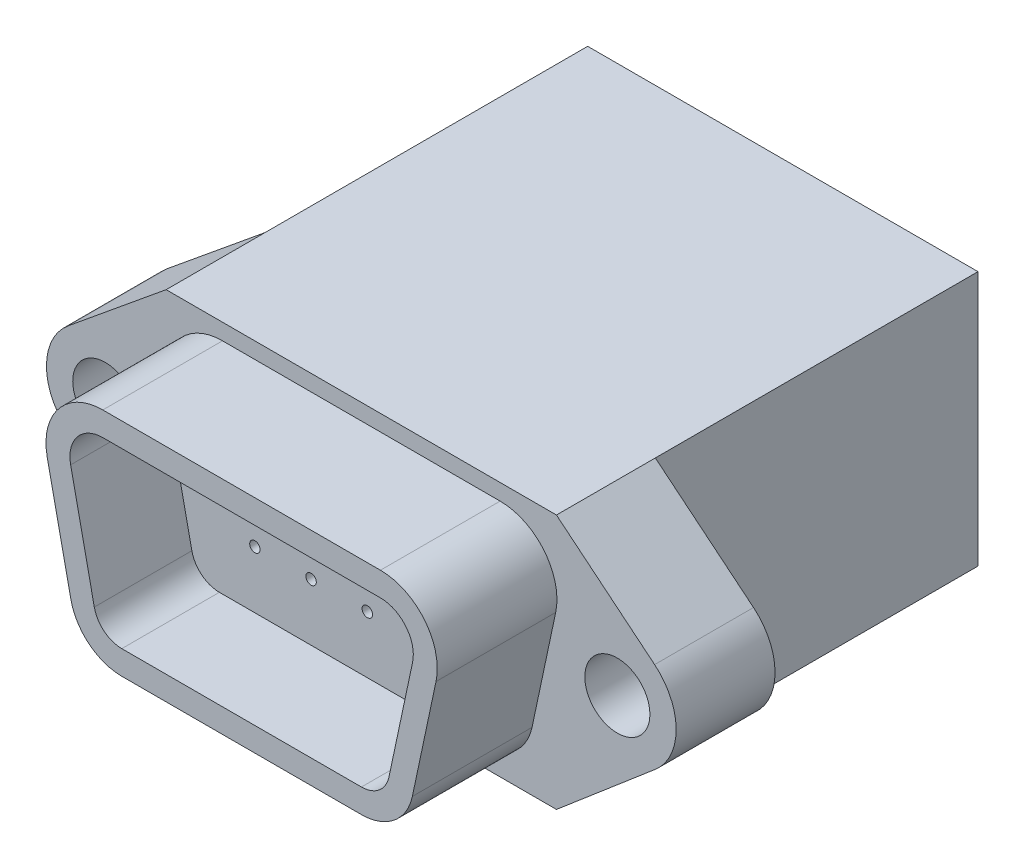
ISO-10303-21;
HEADER;
FILE_DESCRIPTION(('STEP AP214'),'2;1');
FILE_NAME('part.step','',(''),(''),'','','');
FILE_SCHEMA(('AUTOMOTIVE_DESIGN { 1 0 10303 214 1 1 1 1 }'));
ENDSEC;
DATA;
#1=APPLICATION_CONTEXT('core data for automotive mechanical design processes');
#2=APPLICATION_PROTOCOL_DEFINITION('international standard','automotive_design',2000,#1);
#3=PRODUCT_CONTEXT('',#1,'mechanical');
#4=PRODUCT('Part','Part','',(#3));
#5=PRODUCT_RELATED_PRODUCT_CATEGORY('part','',(#4));
#6=PRODUCT_DEFINITION_FORMATION('','',#4);
#7=PRODUCT_DEFINITION_CONTEXT('part definition',#1,'design');
#8=PRODUCT_DEFINITION('design','',#6,#7);
#9=PRODUCT_DEFINITION_SHAPE('','',#8);
#10=(LENGTH_UNIT() NAMED_UNIT(*) SI_UNIT(.MILLI.,.METRE.));
#11=(NAMED_UNIT(*) PLANE_ANGLE_UNIT() SI_UNIT($,.RADIAN.));
#12=(NAMED_UNIT(*) SI_UNIT($,.STERADIAN.) SOLID_ANGLE_UNIT());
#13=UNCERTAINTY_MEASURE_WITH_UNIT(LENGTH_MEASURE(1.E-05),#10,'distance_accuracy_value','');
#14=(GEOMETRIC_REPRESENTATION_CONTEXT(3) GLOBAL_UNCERTAINTY_ASSIGNED_CONTEXT((#13)) GLOBAL_UNIT_ASSIGNED_CONTEXT((#10,
#11,#12)) REPRESENTATION_CONTEXT('',''));
#15=CARTESIAN_POINT('',(0.,0.,0.));
#16=DIRECTION('',(0.,0.,1.));
#17=DIRECTION('',(1.,0.,0.));
#18=AXIS2_PLACEMENT_3D('',#15,#16,#17);
#19=CARTESIAN_POINT('',(6.77545,1.21479901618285,0.));
#20=DIRECTION('',(0.,0.,-1.));
#21=DIRECTION('',(-1.,0.,0.));
#22=AXIS2_PLACEMENT_3D('',#19,#20,#21);
#23=PLANE('',#22);
#24=DIRECTION('',(0.,-1.,0.));
#25=VECTOR('',#24,1.);
#26=CARTESIAN_POINT('',(9.525,-7.6708,0.));
#27=LINE('',#26,#25);
#28=CARTESIAN_POINT('',(9.525,4.7752,0.));
#29=VERTEX_POINT('',#28);
#30=CARTESIAN_POINT('',(9.525,-7.6708,0.));
#31=VERTEX_POINT('',#30);
#32=EDGE_CURVE('E230',#29,#31,#27,.T.);
#33=ORIENTED_EDGE('',*,*,#32,.F.);
#34=DIRECTION('',(0.773414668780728,-0.633900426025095,0.));
#35=VECTOR('',#34,1.);
#36=CARTESIAN_POINT('',(9.525,4.7752,0.));
#37=LINE('',#36,#35);
#38=CARTESIAN_POINT('',(14.3162210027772,0.848254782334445,0.));
#39=VERTEX_POINT('',#38);
#40=EDGE_CURVE('E367',#29,#39,#37,.T.);
#41=ORIENTED_EDGE('',*,*,#40,.T.);
#42=CARTESIAN_POINT('',(12.4968,-1.3716,0.));
#43=DIRECTION('',(0.,0.,-1.));
#44=DIRECTION('',(-1.,0.,0.));
#45=AXIS2_PLACEMENT_3D('',#42,#43,#44);
#46=CIRCLE('',#45,2.8702);
#47=CARTESIAN_POINT('',(14.357309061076,-3.5571329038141,0.));
#48=VERTEX_POINT('',#47);
#49=EDGE_CURVE('E370',#39,#48,#46,.T.);
#50=ORIENTED_EDGE('',*,*,#49,.T.);
#51=DIRECTION('',(-0.761456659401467,-0.648215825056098,0.));
#52=VECTOR('',#51,1.);
#53=CARTESIAN_POINT('',(9.525,-7.6708,0.));
#54=LINE('',#53,#52);
#55=EDGE_CURVE('E373',#48,#31,#54,.T.);
#56=ORIENTED_EDGE('',*,*,#55,.T.);
#57=EDGE_LOOP('',(#33,#41,#50,#56));
#58=FACE_BOUND('',#57,.T.);
#59=CARTESIAN_POINT('',(12.4968,-1.3716,0.));
#60=DIRECTION('',(0.,0.,-1.));
#61=DIRECTION('',(-1.,0.,0.));
#62=AXIS2_PLACEMENT_3D('',#59,#60,#61);
#63=CIRCLE('',#62,1.5875);
#64=CARTESIAN_POINT('',(10.9093,-1.3716,0.));
#65=VERTEX_POINT('',#64);
#66=EDGE_CURVE('E328',#65,#65,#63,.T.);
#67=ORIENTED_EDGE('',*,*,#66,.F.);
#68=EDGE_LOOP('',(#67));
#69=FACE_BOUND('',#68,.T.);
#70=ADVANCED_FACE('F34',(#58,#69),#23,.T.);
#71=CARTESIAN_POINT('',(6.77545,1.21479901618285,10.668));
#72=DIRECTION('',(0.,0.,-1.));
#73=DIRECTION('',(-1.,0.,0.));
#74=AXIS2_PLACEMENT_3D('',#71,#72,#73);
#75=CYLINDRICAL_SURFACE('',#74,2.77300098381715);
#76=CARTESIAN_POINT('',(6.77545,1.21479901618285,4.826));
#77=DIRECTION('',(0.,0.,-1.));
#78=DIRECTION('',(-1.,0.,0.));
#79=AXIS2_PLACEMENT_3D('',#76,#77,#78);
#80=CIRCLE('',#79,2.77300098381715);
#81=CARTESIAN_POINT('',(6.77545,3.9878,4.826));
#82=VERTEX_POINT('',#81);
#83=CARTESIAN_POINT('',(9.48785425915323,0.638259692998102,4.826));
#84=VERTEX_POINT('',#83);
#85=EDGE_CURVE('E59',#82,#84,#80,.T.);
#86=ORIENTED_EDGE('',*,*,#85,.F.);
#87=DIRECTION('',(0.,0.,-1.));
#88=VECTOR('',#87,1.);
#89=CARTESIAN_POINT('',(6.77545,3.9878,10.668));
#90=LINE('',#89,#88);
#91=CARTESIAN_POINT('',(6.77545,3.9878,10.668));
#92=VERTEX_POINT('',#91);
#93=EDGE_CURVE('E11',#92,#82,#90,.T.);
#94=ORIENTED_EDGE('',*,*,#93,.F.);
#95=CARTESIAN_POINT('',(6.77545,1.21479901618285,10.668));
#96=DIRECTION('',(0.,0.,1.));
#97=DIRECTION('',(-1.,0.,0.));
#98=AXIS2_PLACEMENT_3D('',#95,#96,#97);
#99=CIRCLE('',#98,2.77300098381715);
#100=CARTESIAN_POINT('',(9.48785425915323,0.638259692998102,10.668));
#101=VERTEX_POINT('',#100);
#102=EDGE_CURVE('E444',#101,#92,#99,.T.);
#103=ORIENTED_EDGE('',*,*,#102,.F.);
#104=DIRECTION('',(0.,0.,-1.));
#105=VECTOR('',#104,1.);
#106=CARTESIAN_POINT('',(9.48785425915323,0.638259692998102,10.668));
#107=LINE('',#106,#105);
#108=EDGE_CURVE('E461',#101,#84,#107,.T.);
#109=ORIENTED_EDGE('',*,*,#108,.T.);
#110=EDGE_LOOP('',(#86,#94,#103,#109));
#111=FACE_BOUND('',#110,.T.);
#112=ADVANCED_FACE('F36',(#111),#75,.T.);
#113=CARTESIAN_POINT('',(6.77545,3.9878,10.668));
#114=DIRECTION('',(0.,-1.,0.));
#115=DIRECTION('',(1.,0.,0.));
#116=AXIS2_PLACEMENT_3D('',#113,#114,#115);
#117=PLANE('',#116);
#118=DIRECTION('',(1.,0.,0.));
#119=VECTOR('',#118,1.);
#120=CARTESIAN_POINT('',(6.77545,3.9878,4.826));
#121=LINE('',#120,#119);
#122=CARTESIAN_POINT('',(-6.77545,3.9878,4.826));
#123=VERTEX_POINT('',#122);
#124=EDGE_CURVE('E440',#123,#82,#121,.T.);
#125=ORIENTED_EDGE('',*,*,#124,.F.);
#126=DIRECTION('',(0.,0.,-1.));
#127=VECTOR('',#126,1.);
#128=CARTESIAN_POINT('',(-6.77545,3.9878,10.668));
#129=LINE('',#128,#127);
#130=CARTESIAN_POINT('',(-6.77545,3.9878,10.668));
#131=VERTEX_POINT('',#130);
#132=EDGE_CURVE('E43',#131,#123,#129,.T.);
#133=ORIENTED_EDGE('',*,*,#132,.F.);
#134=DIRECTION('',(-1.,0.,0.));
#135=VECTOR('',#134,1.);
#136=CARTESIAN_POINT('',(6.77545,3.9878,10.668));
#137=LINE('',#136,#135);
#138=EDGE_CURVE('E447',#92,#131,#137,.T.);
#139=ORIENTED_EDGE('',*,*,#138,.F.);
#140=ORIENTED_EDGE('',*,*,#93,.T.);
#141=EDGE_LOOP('',(#125,#133,#139,#140));
#142=FACE_BOUND('',#141,.T.);
#143=ADVANCED_FACE('F516',(#142),#117,.F.);
#144=CARTESIAN_POINT('',(-6.77545,1.21479901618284,10.668));
#145=DIRECTION('',(0.,0.,-1.));
#146=DIRECTION('',(-1.,0.,0.));
#147=AXIS2_PLACEMENT_3D('',#144,#145,#146);
#148=CYLINDRICAL_SURFACE('',#147,2.77300098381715);
#149=CARTESIAN_POINT('',(-6.77545,1.21479901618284,4.826));
#150=DIRECTION('',(0.,0.,-1.));
#151=DIRECTION('',(-1.,0.,0.));
#152=AXIS2_PLACEMENT_3D('',#149,#150,#151);
#153=CIRCLE('',#152,2.77300098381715);
#154=CARTESIAN_POINT('',(-9.48785425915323,0.638259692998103,4.826));
#155=VERTEX_POINT('',#154);
#156=EDGE_CURVE('E437',#155,#123,#153,.T.);
#157=ORIENTED_EDGE('',*,*,#156,.F.);
#158=DIRECTION('',(0.,0.,-1.));
#159=VECTOR('',#158,1.);
#160=CARTESIAN_POINT('',(-9.48785425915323,0.638259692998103,10.668));
#161=LINE('',#160,#159);
#162=CARTESIAN_POINT('',(-9.48785425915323,0.638259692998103,10.668));
#163=VERTEX_POINT('',#162);
#164=EDGE_CURVE('E474',#163,#155,#161,.T.);
#165=ORIENTED_EDGE('',*,*,#164,.F.);
#166=CARTESIAN_POINT('',(-6.77545,1.21479901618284,10.668));
#167=DIRECTION('',(0.,0.,1.));
#168=DIRECTION('',(1.,0.,0.));
#169=AXIS2_PLACEMENT_3D('',#166,#167,#168);
#170=CIRCLE('',#169,2.77300098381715);
#171=EDGE_CURVE('E449',#131,#163,#170,.T.);
#172=ORIENTED_EDGE('',*,*,#171,.F.);
#173=ORIENTED_EDGE('',*,*,#132,.T.);
#174=EDGE_LOOP('',(#157,#165,#172,#173));
#175=FACE_BOUND('',#174,.T.);
#176=ADVANCED_FACE('F865',(#175),#148,.T.);
#177=CARTESIAN_POINT('',(-9.48785425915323,0.638259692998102,10.668));
#178=DIRECTION('',(0.978147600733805,0.207911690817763,0.));
#179=DIRECTION('',(-0.207911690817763,0.978147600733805,0.));
#180=AXIS2_PLACEMENT_3D('',#177,#178,#179);
#181=PLANE('',#180);
#182=DIRECTION('',(-0.207911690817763,0.978147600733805,0.));
#183=VECTOR('',#182,1.);
#184=CARTESIAN_POINT('',(-9.48785425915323,0.638259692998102,4.826));
#185=LINE('',#184,#183);
#186=CARTESIAN_POINT('',(-8.33291641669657,-4.79529565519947,4.826));
#187=VERTEX_POINT('',#186);
#188=EDGE_CURVE('E434',#187,#155,#185,.T.);
#189=ORIENTED_EDGE('',*,*,#188,.F.);
#190=DIRECTION('',(0.,0.,-1.));
#191=VECTOR('',#190,1.);
#192=CARTESIAN_POINT('',(-8.33291641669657,-4.79529565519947,10.668));
#193=LINE('',#192,#191);
#194=CARTESIAN_POINT('',(-8.33291641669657,-4.79529565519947,10.668));
#195=VERTEX_POINT('',#194);
#196=EDGE_CURVE('E471',#195,#187,#193,.T.);
#197=ORIENTED_EDGE('',*,*,#196,.F.);
#198=DIRECTION('',(0.207911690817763,-0.978147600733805,0.));
#199=VECTOR('',#198,1.);
#200=CARTESIAN_POINT('',(-9.48785425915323,0.638259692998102,10.668));
#201=LINE('',#200,#199);
#202=EDGE_CURVE('E451',#163,#195,#201,.T.);
#203=ORIENTED_EDGE('',*,*,#202,.F.);
#204=ORIENTED_EDGE('',*,*,#164,.T.);
#205=EDGE_LOOP('',(#189,#197,#203,#204));
#206=FACE_BOUND('',#205,.T.);
#207=ADVANCED_FACE('F873',(#206),#181,.F.);
#208=CARTESIAN_POINT('',(-5.84842146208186,-4.26719995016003,10.668));
#209=DIRECTION('',(0.,0.,-1.));
#210=DIRECTION('',(-1.,0.,0.));
#211=AXIS2_PLACEMENT_3D('',#208,#209,#210);
#212=CYLINDRICAL_SURFACE('',#211,2.54000004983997);
#213=CARTESIAN_POINT('',(-5.84842146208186,-4.26719995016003,4.826));
#214=DIRECTION('',(0.,0.,-1.));
#215=DIRECTION('',(-1.,0.,0.));
#216=AXIS2_PLACEMENT_3D('',#213,#214,#215);
#217=CIRCLE('',#216,2.54000004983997);
#218=CARTESIAN_POINT('',(-5.84842146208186,-6.8072,4.826));
#219=VERTEX_POINT('',#218);
#220=EDGE_CURVE('E431',#219,#187,#217,.T.);
#221=ORIENTED_EDGE('',*,*,#220,.F.);
#222=DIRECTION('',(0.,0.,-1.));
#223=VECTOR('',#222,1.);
#224=CARTESIAN_POINT('',(-5.84842146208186,-6.8072,10.668));
#225=LINE('',#224,#223);
#226=CARTESIAN_POINT('',(-5.84842146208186,-6.8072,10.668));
#227=VERTEX_POINT('',#226);
#228=EDGE_CURVE('E468',#227,#219,#225,.T.);
#229=ORIENTED_EDGE('',*,*,#228,.F.);
#230=CARTESIAN_POINT('',(-5.84842146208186,-4.26719995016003,10.668));
#231=DIRECTION('',(0.,0.,1.));
#232=DIRECTION('',(1.,0.,0.));
#233=AXIS2_PLACEMENT_3D('',#230,#231,#232);
#234=CIRCLE('',#233,2.54000004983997);
#235=EDGE_CURVE('E453',#195,#227,#234,.T.);
#236=ORIENTED_EDGE('',*,*,#235,.F.);
#237=ORIENTED_EDGE('',*,*,#196,.T.);
#238=EDGE_LOOP('',(#221,#229,#236,#237));
#239=FACE_BOUND('',#238,.T.);
#240=ADVANCED_FACE('F882',(#239),#212,.T.);
#241=CARTESIAN_POINT('',(-5.84842146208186,-6.8072,10.668));
#242=DIRECTION('',(0.,1.,0.));
#243=DIRECTION('',(0.,0.,1.));
#244=AXIS2_PLACEMENT_3D('',#241,#242,#243);
#245=PLANE('',#244);
#246=DIRECTION('',(-1.,0.,0.));
#247=VECTOR('',#246,1.);
#248=CARTESIAN_POINT('',(-5.84842146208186,-6.8072,4.826));
#249=LINE('',#248,#247);
#250=CARTESIAN_POINT('',(5.84842146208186,-6.8072,4.826));
#251=VERTEX_POINT('',#250);
#252=EDGE_CURVE('E428',#251,#219,#249,.T.);
#253=ORIENTED_EDGE('',*,*,#252,.F.);
#254=DIRECTION('',(0.,0.,-1.));
#255=VECTOR('',#254,1.);
#256=CARTESIAN_POINT('',(5.84842146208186,-6.8072,10.668));
#257=LINE('',#256,#255);
#258=CARTESIAN_POINT('',(5.84842146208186,-6.8072,10.668));
#259=VERTEX_POINT('',#258);
#260=EDGE_CURVE('E465',#259,#251,#257,.T.);
#261=ORIENTED_EDGE('',*,*,#260,.F.);
#262=DIRECTION('',(1.,0.,0.));
#263=VECTOR('',#262,1.);
#264=CARTESIAN_POINT('',(-5.84842146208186,-6.8072,10.668));
#265=LINE('',#264,#263);
#266=EDGE_CURVE('E455',#227,#259,#265,.T.);
#267=ORIENTED_EDGE('',*,*,#266,.F.);
#268=ORIENTED_EDGE('',*,*,#228,.T.);
#269=EDGE_LOOP('',(#253,#261,#267,#268));
#270=FACE_BOUND('',#269,.T.);
#271=ADVANCED_FACE('F891',(#270),#245,.F.);
#272=CARTESIAN_POINT('',(5.84842146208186,-4.26719995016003,10.668));
#273=DIRECTION('',(0.,0.,-1.));
#274=DIRECTION('',(-1.,0.,0.));
#275=AXIS2_PLACEMENT_3D('',#272,#273,#274);
#276=CYLINDRICAL_SURFACE('',#275,2.54000004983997);
#277=CARTESIAN_POINT('',(5.84842146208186,-4.26719995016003,4.826));
#278=DIRECTION('',(0.,0.,-1.));
#279=DIRECTION('',(-1.,0.,0.));
#280=AXIS2_PLACEMENT_3D('',#277,#278,#279);
#281=CIRCLE('',#280,2.54000004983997);
#282=CARTESIAN_POINT('',(8.33291641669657,-4.79529565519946,4.826));
#283=VERTEX_POINT('',#282);
#284=EDGE_CURVE('E425',#283,#251,#281,.T.);
#285=ORIENTED_EDGE('',*,*,#284,.F.);
#286=DIRECTION('',(0.,0.,-1.));
#287=VECTOR('',#286,1.);
#288=CARTESIAN_POINT('',(8.33291641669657,-4.79529565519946,10.668));
#289=LINE('',#288,#287);
#290=CARTESIAN_POINT('',(8.33291641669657,-4.79529565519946,10.668));
#291=VERTEX_POINT('',#290);
#292=EDGE_CURVE('E463',#291,#283,#289,.T.);
#293=ORIENTED_EDGE('',*,*,#292,.F.);
#294=CARTESIAN_POINT('',(5.84842146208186,-4.26719995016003,10.668));
#295=DIRECTION('',(0.,0.,1.));
#296=DIRECTION('',(-1.,0.,0.));
#297=AXIS2_PLACEMENT_3D('',#294,#295,#296);
#298=CIRCLE('',#297,2.54000004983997);
#299=EDGE_CURVE('E457',#259,#291,#298,.T.);
#300=ORIENTED_EDGE('',*,*,#299,.F.);
#301=ORIENTED_EDGE('',*,*,#260,.T.);
#302=EDGE_LOOP('',(#285,#293,#300,#301));
#303=FACE_BOUND('',#302,.T.);
#304=ADVANCED_FACE('F900',(#303),#276,.T.);
#305=CARTESIAN_POINT('',(9.48785425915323,0.638259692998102,10.668));
#306=DIRECTION('',(-0.978147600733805,0.207911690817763,0.));
#307=DIRECTION('',(-0.207911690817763,-0.978147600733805,0.));
#308=AXIS2_PLACEMENT_3D('',#305,#306,#307);
#309=PLANE('',#308);
#310=DIRECTION('',(-0.207911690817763,-0.978147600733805,0.));
#311=VECTOR('',#310,1.);
#312=CARTESIAN_POINT('',(9.48785425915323,0.638259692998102,4.826));
#313=LINE('',#312,#311);
#314=EDGE_CURVE('E422',#84,#283,#313,.T.);
#315=ORIENTED_EDGE('',*,*,#314,.F.);
#316=ORIENTED_EDGE('',*,*,#108,.F.);
#317=DIRECTION('',(0.207911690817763,0.978147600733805,0.));
#318=VECTOR('',#317,1.);
#319=CARTESIAN_POINT('',(9.48785425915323,0.638259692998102,10.668));
#320=LINE('',#319,#318);
#321=EDGE_CURVE('E459',#291,#101,#320,.T.);
#322=ORIENTED_EDGE('',*,*,#321,.F.);
#323=ORIENTED_EDGE('',*,*,#292,.T.);
#324=EDGE_LOOP('',(#315,#316,#322,#323));
#325=FACE_BOUND('',#324,.T.);
#326=ADVANCED_FACE('F775',(#325),#309,.F.);
#327=CARTESIAN_POINT('',(6.77545,1.21479901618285,10.668));
#328=DIRECTION('',(0.,0.,-1.));
#329=DIRECTION('',(-1.,0.,0.));
#330=AXIS2_PLACEMENT_3D('',#327,#328,#329);
#331=PLANE('',#330);
#332=DIRECTION('',(-1.,0.,0.));
#333=VECTOR('',#332,1.);
#334=CARTESIAN_POINT('',(6.77545,2.8194,10.668));
#335=LINE('',#334,#333);
#336=CARTESIAN_POINT('',(6.77545,2.8194,10.668));
#337=VERTEX_POINT('',#336);
#338=CARTESIAN_POINT('',(-6.77545,2.8194,10.668));
#339=VERTEX_POINT('',#338);
#340=EDGE_CURVE('E238',#337,#339,#335,.T.);
#341=ORIENTED_EDGE('',*,*,#340,.F.);
#342=CARTESIAN_POINT('',(6.77545,1.21479901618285,10.668));
#343=DIRECTION('',(0.,0.,1.));
#344=DIRECTION('',(1.,0.,0.));
#345=AXIS2_PLACEMENT_3D('',#342,#343,#344);
#346=CIRCLE('',#345,1.60460098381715);
#347=CARTESIAN_POINT('',(8.34498660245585,0.881183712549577,10.668));
#348=VERTEX_POINT('',#347);
#349=EDGE_CURVE('E51',#348,#337,#346,.T.);
#350=ORIENTED_EDGE('',*,*,#349,.F.);
#351=DIRECTION('',(0.207911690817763,0.978147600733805,0.));
#352=VECTOR('',#351,1.);
#353=CARTESIAN_POINT('',(7.1900487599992,-4.55237163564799,10.668));
#354=LINE('',#353,#352);
#355=CARTESIAN_POINT('',(7.1900487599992,-4.55237163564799,10.668));
#356=VERTEX_POINT('',#355);
#357=EDGE_CURVE('E248',#356,#348,#354,.T.);
#358=ORIENTED_EDGE('',*,*,#357,.F.);
#359=CARTESIAN_POINT('',(5.84842146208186,-4.26719995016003,10.668));
#360=DIRECTION('',(0.,0.,1.));
#361=DIRECTION('',(1.,0.,0.));
#362=AXIS2_PLACEMENT_3D('',#359,#360,#361);
#363=CIRCLE('',#362,1.37160004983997);
#364=CARTESIAN_POINT('',(5.84842146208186,-5.6388,10.668));
#365=VERTEX_POINT('',#364);
#366=EDGE_CURVE('E284',#365,#356,#363,.T.);
#367=ORIENTED_EDGE('',*,*,#366,.F.);
#368=DIRECTION('',(1.,0.,0.));
#369=VECTOR('',#368,1.);
#370=CARTESIAN_POINT('',(-5.84842146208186,-5.6388,10.668));
#371=LINE('',#370,#369);
#372=CARTESIAN_POINT('',(-5.84842146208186,-5.6388,10.668));
#373=VERTEX_POINT('',#372);
#374=EDGE_CURVE('E281',#373,#365,#371,.T.);
#375=ORIENTED_EDGE('',*,*,#374,.F.);
#376=CARTESIAN_POINT('',(-5.84842146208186,-4.26719995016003,10.668));
#377=DIRECTION('',(0.,0.,1.));
#378=DIRECTION('',(1.,0.,0.));
#379=AXIS2_PLACEMENT_3D('',#376,#377,#378);
#380=CIRCLE('',#379,1.37160004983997);
#381=CARTESIAN_POINT('',(-7.19004875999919,-4.55237163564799,10.668));
#382=VERTEX_POINT('',#381);
#383=EDGE_CURVE('E278',#382,#373,#380,.T.);
#384=ORIENTED_EDGE('',*,*,#383,.F.);
#385=DIRECTION('',(0.207911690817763,-0.978147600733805,0.));
#386=VECTOR('',#385,1.);
#387=CARTESIAN_POINT('',(-8.34498660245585,0.881183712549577,10.668));
#388=LINE('',#387,#386);
#389=CARTESIAN_POINT('',(-8.34498660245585,0.881183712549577,10.668));
#390=VERTEX_POINT('',#389);
#391=EDGE_CURVE('E275',#390,#382,#388,.T.);
#392=ORIENTED_EDGE('',*,*,#391,.F.);
#393=CARTESIAN_POINT('',(-6.77545,1.21479901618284,10.668));
#394=DIRECTION('',(0.,0.,1.));
#395=DIRECTION('',(1.,0.,0.));
#396=AXIS2_PLACEMENT_3D('',#393,#394,#395);
#397=CIRCLE('',#396,1.60460098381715);
#398=EDGE_CURVE('E272',#339,#390,#397,.T.);
#399=ORIENTED_EDGE('',*,*,#398,.F.);
#400=EDGE_LOOP('',(#341,#350,#358,#367,#375,#384,#392,#399));
#401=FACE_BOUND('',#400,.T.);
#402=ORIENTED_EDGE('',*,*,#102,.T.);
#403=ORIENTED_EDGE('',*,*,#138,.T.);
#404=ORIENTED_EDGE('',*,*,#171,.T.);
#405=ORIENTED_EDGE('',*,*,#202,.T.);
#406=ORIENTED_EDGE('',*,*,#235,.T.);
#407=ORIENTED_EDGE('',*,*,#266,.T.);
#408=ORIENTED_EDGE('',*,*,#299,.T.);
#409=ORIENTED_EDGE('',*,*,#321,.T.);
#410=EDGE_LOOP('',(#402,#403,#404,#405,#406,#407,#408,#409));
#411=FACE_BOUND('',#410,.T.);
#412=ADVANCED_FACE('F502',(#401,#411),#331,.F.);
#413=CARTESIAN_POINT('',(-12.4968,-1.3716,4.826));
#414=DIRECTION('',(0.,0.,-1.));
#415=DIRECTION('',(-1.,0.,0.));
#416=AXIS2_PLACEMENT_3D('',#413,#414,#415);
#417=PLANE('',#416);
#418=CARTESIAN_POINT('',(12.4968,-1.3716,4.826));
#419=DIRECTION('',(0.,0.,-1.));
#420=DIRECTION('',(-1.,0.,0.));
#421=AXIS2_PLACEMENT_3D('',#418,#419,#420);
#422=CIRCLE('',#421,1.5875);
#423=CARTESIAN_POINT('',(10.9093,-1.3716,4.826));
#424=VERTEX_POINT('',#423);
#425=EDGE_CURVE('E329',#424,#424,#422,.T.);
#426=ORIENTED_EDGE('',*,*,#425,.T.);
#427=EDGE_LOOP('',(#426));
#428=FACE_BOUND('',#427,.T.);
#429=CARTESIAN_POINT('',(-12.4968,-1.3716,4.826));
#430=DIRECTION('',(0.,0.,-1.));
#431=DIRECTION('',(-1.,0.,0.));
#432=AXIS2_PLACEMENT_3D('',#429,#430,#431);
#433=CIRCLE('',#432,1.5875);
#434=CARTESIAN_POINT('',(-14.0843,-1.3716,4.826));
#435=VERTEX_POINT('',#434);
#436=EDGE_CURVE('E335',#435,#435,#433,.T.);
#437=ORIENTED_EDGE('',*,*,#436,.T.);
#438=EDGE_LOOP('',(#437));
#439=FACE_BOUND('',#438,.T.);
#440=DIRECTION('',(0.773414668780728,0.633900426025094,0.));
#441=VECTOR('',#440,1.);
#442=CARTESIAN_POINT('',(-9.525,4.7752,4.826));
#443=LINE('',#442,#441);
#444=CARTESIAN_POINT('',(-14.3162210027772,0.848254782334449,4.826));
#445=VERTEX_POINT('',#444);
#446=CARTESIAN_POINT('',(-9.525,4.7752,4.826));
#447=VERTEX_POINT('',#446);
#448=EDGE_CURVE('E341',#445,#447,#443,.T.);
#449=ORIENTED_EDGE('',*,*,#448,.F.);
#450=CARTESIAN_POINT('',(-12.4968,-1.3716,4.826));
#451=DIRECTION('',(0.,0.,-1.));
#452=DIRECTION('',(-1.,0.,0.));
#453=AXIS2_PLACEMENT_3D('',#450,#451,#452);
#454=CIRCLE('',#453,2.8702);
#455=CARTESIAN_POINT('',(-14.357309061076,-3.55713290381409,4.826));
#456=VERTEX_POINT('',#455);
#457=EDGE_CURVE('E362',#456,#445,#454,.T.);
#458=ORIENTED_EDGE('',*,*,#457,.F.);
#459=DIRECTION('',(-0.761456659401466,0.6482158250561,0.));
#460=VECTOR('',#459,1.);
#461=CARTESIAN_POINT('',(-9.525,-7.6708,4.826));
#462=LINE('',#461,#460);
#463=CARTESIAN_POINT('',(-9.525,-7.6708,4.826));
#464=VERTEX_POINT('',#463);
#465=EDGE_CURVE('E359',#464,#456,#462,.T.);
#466=ORIENTED_EDGE('',*,*,#465,.F.);
#467=DIRECTION('',(-1.,0.,0.));
#468=VECTOR('',#467,1.);
#469=CARTESIAN_POINT('',(-9.525,-7.6708,4.826));
#470=LINE('',#469,#468);
#471=CARTESIAN_POINT('',(9.525,-7.6708,4.826));
#472=VERTEX_POINT('',#471);
#473=EDGE_CURVE('E357',#472,#464,#470,.T.);
#474=ORIENTED_EDGE('',*,*,#473,.F.);
#475=DIRECTION('',(-0.761456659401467,-0.648215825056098,0.));
#476=VECTOR('',#475,1.);
#477=CARTESIAN_POINT('',(9.525,-7.6708,4.826));
#478=LINE('',#477,#476);
#479=CARTESIAN_POINT('',(14.357309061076,-3.5571329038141,4.826));
#480=VERTEX_POINT('',#479);
#481=EDGE_CURVE('E354',#480,#472,#478,.T.);
#482=ORIENTED_EDGE('',*,*,#481,.F.);
#483=CARTESIAN_POINT('',(12.4968,-1.3716,4.826));
#484=DIRECTION('',(0.,0.,-1.));
#485=DIRECTION('',(-1.,0.,0.));
#486=AXIS2_PLACEMENT_3D('',#483,#484,#485);
#487=CIRCLE('',#486,2.8702);
#488=CARTESIAN_POINT('',(14.3162210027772,0.848254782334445,4.826));
#489=VERTEX_POINT('',#488);
#490=EDGE_CURVE('E351',#489,#480,#487,.T.);
#491=ORIENTED_EDGE('',*,*,#490,.F.);
#492=DIRECTION('',(0.773414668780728,-0.633900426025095,0.));
#493=VECTOR('',#492,1.);
#494=CARTESIAN_POINT('',(9.525,4.7752,4.826));
#495=LINE('',#494,#493);
#496=CARTESIAN_POINT('',(9.525,4.7752,4.826));
#497=VERTEX_POINT('',#496);
#498=EDGE_CURVE('E348',#497,#489,#495,.T.);
#499=ORIENTED_EDGE('',*,*,#498,.F.);
#500=DIRECTION('',(1.,0.,0.));
#501=VECTOR('',#500,1.);
#502=CARTESIAN_POINT('',(-9.525,4.7752,4.826));
#503=LINE('',#502,#501);
#504=EDGE_CURVE('E344',#447,#497,#503,.T.);
#505=ORIENTED_EDGE('',*,*,#504,.F.);
#506=EDGE_LOOP('',(#449,#458,#466,#474,#482,#491,#499,#505));
#507=FACE_BOUND('',#506,.T.);
#508=ORIENTED_EDGE('',*,*,#124,.T.);
#509=ORIENTED_EDGE('',*,*,#85,.T.);
#510=ORIENTED_EDGE('',*,*,#314,.T.);
#511=ORIENTED_EDGE('',*,*,#284,.T.);
#512=ORIENTED_EDGE('',*,*,#252,.T.);
#513=ORIENTED_EDGE('',*,*,#220,.T.);
#514=ORIENTED_EDGE('',*,*,#188,.T.);
#515=ORIENTED_EDGE('',*,*,#156,.T.);
#516=EDGE_LOOP('',(#508,#509,#510,#511,#512,#513,#514,#515));
#517=FACE_BOUND('',#516,.T.);
#518=ADVANCED_FACE('F488',(#428,#439,#507,#517),#417,.F.);
#519=CARTESIAN_POINT('',(-9.525,4.7752,4.826));
#520=DIRECTION('',(-0.633900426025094,0.773414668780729,0.));
#521=DIRECTION('',(-0.773414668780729,-0.633900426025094,0.));
#522=AXIS2_PLACEMENT_3D('',#519,#520,#521);
#523=PLANE('',#522);
#524=DIRECTION('',(0.773414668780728,0.633900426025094,0.));
#525=VECTOR('',#524,1.);
#526=CARTESIAN_POINT('',(-9.525,4.7752,0.));
#527=LINE('',#526,#525);
#528=CARTESIAN_POINT('',(-14.3162210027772,0.848254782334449,0.));
#529=VERTEX_POINT('',#528);
#530=CARTESIAN_POINT('',(-9.525,4.7752,0.));
#531=VERTEX_POINT('',#530);
#532=EDGE_CURVE('E338',#529,#531,#527,.T.);
#533=ORIENTED_EDGE('',*,*,#532,.F.);
#534=DIRECTION('',(0.,0.,-1.));
#535=VECTOR('',#534,1.);
#536=CARTESIAN_POINT('',(-14.3162210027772,0.848254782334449,4.826));
#537=LINE('',#536,#535);
#538=EDGE_CURVE('E381',#445,#529,#537,.T.);
#539=ORIENTED_EDGE('',*,*,#538,.F.);
#540=ORIENTED_EDGE('',*,*,#448,.T.);
#541=DIRECTION('',(0.,0.,-1.));
#542=VECTOR('',#541,1.);
#543=CARTESIAN_POINT('',(-9.525,4.7752,4.826));
#544=LINE('',#543,#542);
#545=EDGE_CURVE('E365',#447,#531,#544,.T.);
#546=ORIENTED_EDGE('',*,*,#545,.T.);
#547=EDGE_LOOP('',(#533,#539,#540,#546));
#548=FACE_BOUND('',#547,.T.);
#549=ADVANCED_FACE('F501',(#548),#523,.T.);
#550=CARTESIAN_POINT('',(-12.4968,-1.3716,4.826));
#551=DIRECTION('',(0.,0.,-1.));
#552=DIRECTION('',(-1.,0.,0.));
#553=AXIS2_PLACEMENT_3D('',#550,#551,#552);
#554=CYLINDRICAL_SURFACE('',#553,2.8702);
#555=CARTESIAN_POINT('',(-12.4968,-1.3716,0.));
#556=DIRECTION('',(0.,0.,-1.));
#557=DIRECTION('',(-1.,0.,0.));
#558=AXIS2_PLACEMENT_3D('',#555,#556,#557);
#559=CIRCLE('',#558,2.8702);
#560=CARTESIAN_POINT('',(-14.357309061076,-3.55713290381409,0.));
#561=VERTEX_POINT('',#560);
#562=EDGE_CURVE('E345',#561,#529,#559,.T.);
#563=ORIENTED_EDGE('',*,*,#562,.F.);
#564=DIRECTION('',(0.,0.,-1.));
#565=VECTOR('',#564,1.);
#566=CARTESIAN_POINT('',(-14.357309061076,-3.55713290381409,4.826));
#567=LINE('',#566,#565);
#568=EDGE_CURVE('E384',#456,#561,#567,.T.);
#569=ORIENTED_EDGE('',*,*,#568,.F.);
#570=ORIENTED_EDGE('',*,*,#457,.T.);
#571=ORIENTED_EDGE('',*,*,#538,.T.);
#572=EDGE_LOOP('',(#563,#569,#570,#571));
#573=FACE_BOUND('',#572,.T.);
#574=ADVANCED_FACE('F808',(#573),#554,.T.);
#575=CARTESIAN_POINT('',(-9.525,-7.6708,4.826));
#576=DIRECTION('',(-0.6482158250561,-0.761456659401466,0.));
#577=DIRECTION('',(0.761456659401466,-0.6482158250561,0.));
#578=AXIS2_PLACEMENT_3D('',#575,#576,#577);
#579=PLANE('',#578);
#580=DIRECTION('',(-0.761456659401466,0.6482158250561,0.));
#581=VECTOR('',#580,1.);
#582=CARTESIAN_POINT('',(-9.525,-7.6708,0.));
#583=LINE('',#582,#581);
#584=CARTESIAN_POINT('',(-9.525,-7.6708,0.));
#585=VERTEX_POINT('',#584);
#586=EDGE_CURVE('E376',#585,#561,#583,.T.);
#587=ORIENTED_EDGE('',*,*,#586,.F.);
#588=DIRECTION('',(0.,0.,-1.));
#589=VECTOR('',#588,1.);
#590=CARTESIAN_POINT('',(-9.525,-7.6708,4.826));
#591=LINE('',#590,#589);
#592=EDGE_CURVE('E235',#464,#585,#591,.T.);
#593=ORIENTED_EDGE('',*,*,#592,.F.);
#594=ORIENTED_EDGE('',*,*,#465,.T.);
#595=ORIENTED_EDGE('',*,*,#568,.T.);
#596=EDGE_LOOP('',(#587,#593,#594,#595));
#597=FACE_BOUND('',#596,.T.);
#598=ADVANCED_FACE('F813',(#597),#579,.T.);
#599=CARTESIAN_POINT('',(-9.525,-7.6708,4.826));
#600=DIRECTION('',(0.,-1.,0.));
#601=DIRECTION('',(0.,0.,-1.));
#602=AXIS2_PLACEMENT_3D('',#599,#600,#601);
#603=PLANE('',#602);
#604=ORIENTED_EDGE('',*,*,#592,.T.);
#605=DIRECTION('',(0.,0.,1.));
#606=VECTOR('',#605,1.);
#607=CARTESIAN_POINT('',(-9.525,-7.6708,-15.748));
#608=LINE('',#607,#606);
#609=CARTESIAN_POINT('',(-9.525,-7.6708,-15.748));
#610=VERTEX_POINT('',#609);
#611=EDGE_CURVE('E215',#610,#585,#608,.T.);
#612=ORIENTED_EDGE('',*,*,#611,.F.);
#613=DIRECTION('',(-1.,0.,0.));
#614=VECTOR('',#613,1.);
#615=CARTESIAN_POINT('',(-9.525,-7.6708,-15.748));
#616=LINE('',#615,#614);
#617=CARTESIAN_POINT('',(9.525,-7.6708,-15.748));
#618=VERTEX_POINT('',#617);
#619=EDGE_CURVE('E221',#618,#610,#616,.T.);
#620=ORIENTED_EDGE('',*,*,#619,.F.);
#621=DIRECTION('',(0.,0.,1.));
#622=VECTOR('',#621,1.);
#623=CARTESIAN_POINT('',(9.525,-7.6708,-15.748));
#624=LINE('',#623,#622);
#625=EDGE_CURVE('E975',#618,#31,#624,.T.);
#626=ORIENTED_EDGE('',*,*,#625,.T.);
#627=DIRECTION('',(0.,0.,-1.));
#628=VECTOR('',#627,1.);
#629=CARTESIAN_POINT('',(9.525,-7.6708,4.826));
#630=LINE('',#629,#628);
#631=EDGE_CURVE('E387',#472,#31,#630,.T.);
#632=ORIENTED_EDGE('',*,*,#631,.F.);
#633=ORIENTED_EDGE('',*,*,#473,.T.);
#634=EDGE_LOOP('',(#604,#612,#620,#626,#632,#633));
#635=FACE_BOUND('',#634,.T.);
#636=ADVANCED_FACE('F233',(#635),#603,.T.);
#637=CARTESIAN_POINT('',(9.525,-7.6708,4.826));
#638=DIRECTION('',(0.648215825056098,-0.761456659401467,0.));
#639=DIRECTION('',(0.761456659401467,0.648215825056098,0.));
#640=AXIS2_PLACEMENT_3D('',#637,#638,#639);
#641=PLANE('',#640);
#642=ORIENTED_EDGE('',*,*,#55,.F.);
#643=DIRECTION('',(0.,0.,-1.));
#644=VECTOR('',#643,1.);
#645=CARTESIAN_POINT('',(14.357309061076,-3.5571329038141,4.826));
#646=LINE('',#645,#644);
#647=EDGE_CURVE('E389',#480,#48,#646,.T.);
#648=ORIENTED_EDGE('',*,*,#647,.F.);
#649=ORIENTED_EDGE('',*,*,#481,.T.);
#650=ORIENTED_EDGE('',*,*,#631,.T.);
#651=EDGE_LOOP('',(#642,#648,#649,#650));
#652=FACE_BOUND('',#651,.T.);
#653=ADVANCED_FACE('F798',(#652),#641,.T.);
#654=CARTESIAN_POINT('',(12.4968,-1.3716,4.826));
#655=DIRECTION('',(0.,0.,-1.));
#656=DIRECTION('',(-1.,0.,0.));
#657=AXIS2_PLACEMENT_3D('',#654,#655,#656);
#658=CYLINDRICAL_SURFACE('',#657,2.8702);
#659=ORIENTED_EDGE('',*,*,#49,.F.);
#660=DIRECTION('',(0.,0.,-1.));
#661=VECTOR('',#660,1.);
#662=CARTESIAN_POINT('',(14.3162210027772,0.848254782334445,4.826));
#663=LINE('',#662,#661);
#664=EDGE_CURVE('E391',#489,#39,#663,.T.);
#665=ORIENTED_EDGE('',*,*,#664,.F.);
#666=ORIENTED_EDGE('',*,*,#490,.T.);
#667=ORIENTED_EDGE('',*,*,#647,.T.);
#668=EDGE_LOOP('',(#659,#665,#666,#667));
#669=FACE_BOUND('',#668,.T.);
#670=ADVANCED_FACE('F793',(#669),#658,.T.);
#671=CARTESIAN_POINT('',(9.525,4.7752,4.826));
#672=DIRECTION('',(0.633900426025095,0.773414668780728,0.));
#673=DIRECTION('',(-0.773414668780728,0.633900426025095,0.));
#674=AXIS2_PLACEMENT_3D('',#671,#672,#673);
#675=PLANE('',#674);
#676=ORIENTED_EDGE('',*,*,#40,.F.);
#677=DIRECTION('',(0.,0.,-1.));
#678=VECTOR('',#677,1.);
#679=CARTESIAN_POINT('',(9.525,4.7752,4.826));
#680=LINE('',#679,#678);
#681=EDGE_CURVE('E393',#497,#29,#680,.T.);
#682=ORIENTED_EDGE('',*,*,#681,.F.);
#683=ORIENTED_EDGE('',*,*,#498,.T.);
#684=ORIENTED_EDGE('',*,*,#664,.T.);
#685=EDGE_LOOP('',(#676,#682,#683,#684));
#686=FACE_BOUND('',#685,.T.);
#687=ADVANCED_FACE('F543',(#686),#675,.T.);
#688=CARTESIAN_POINT('',(-9.525,4.7752,4.826));
#689=DIRECTION('',(0.,1.,0.));
#690=DIRECTION('',(-1.,0.,0.));
#691=AXIS2_PLACEMENT_3D('',#688,#689,#690);
#692=PLANE('',#691);
#693=ORIENTED_EDGE('',*,*,#681,.T.);
#694=DIRECTION('',(0.,0.,1.));
#695=VECTOR('',#694,1.);
#696=CARTESIAN_POINT('',(9.525,4.7752,-15.748));
#697=LINE('',#696,#695);
#698=CARTESIAN_POINT('',(9.525,4.7752,-15.748));
#699=VERTEX_POINT('',#698);
#700=EDGE_CURVE('E240',#699,#29,#697,.T.);
#701=ORIENTED_EDGE('',*,*,#700,.F.);
#702=DIRECTION('',(1.,0.,0.));
#703=VECTOR('',#702,1.);
#704=CARTESIAN_POINT('',(9.525,4.7752,-15.748));
#705=LINE('',#704,#703);
#706=CARTESIAN_POINT('',(-9.525,4.7752,-15.748));
#707=VERTEX_POINT('',#706);
#708=EDGE_CURVE('E220',#707,#699,#705,.T.);
#709=ORIENTED_EDGE('',*,*,#708,.F.);
#710=DIRECTION('',(0.,0.,1.));
#711=VECTOR('',#710,1.);
#712=CARTESIAN_POINT('',(-9.525,4.7752,-15.748));
#713=LINE('',#712,#711);
#714=EDGE_CURVE('E217',#707,#531,#713,.T.);
#715=ORIENTED_EDGE('',*,*,#714,.T.);
#716=ORIENTED_EDGE('',*,*,#545,.F.);
#717=ORIENTED_EDGE('',*,*,#504,.T.);
#718=EDGE_LOOP('',(#693,#701,#709,#715,#716,#717));
#719=FACE_BOUND('',#718,.T.);
#720=ADVANCED_FACE('F538',(#719),#692,.T.);
#721=CARTESIAN_POINT('',(-12.4968,-1.3716,4.826));
#722=DIRECTION('',(0.,0.,-1.));
#723=DIRECTION('',(-1.,0.,0.));
#724=AXIS2_PLACEMENT_3D('',#721,#722,#723);
#725=CYLINDRICAL_SURFACE('',#724,1.5875);
#726=ORIENTED_EDGE('',*,*,#436,.F.);
#727=EDGE_LOOP('',(#726));
#728=FACE_BOUND('',#727,.T.);
#729=CARTESIAN_POINT('',(-12.4968,-1.3716,0.));
#730=DIRECTION('',(0.,0.,-1.));
#731=DIRECTION('',(-1.,0.,0.));
#732=AXIS2_PLACEMENT_3D('',#729,#730,#731);
#733=CIRCLE('',#732,1.5875);
#734=CARTESIAN_POINT('',(-14.0843,-1.3716,0.));
#735=VERTEX_POINT('',#734);
#736=EDGE_CURVE('E332',#735,#735,#733,.T.);
#737=ORIENTED_EDGE('',*,*,#736,.T.);
#738=EDGE_LOOP('',(#737));
#739=FACE_BOUND('',#738,.T.);
#740=ADVANCED_FACE('F530',(#728,#739),#725,.F.);
#741=CARTESIAN_POINT('',(12.4968,-1.3716,4.826));
#742=DIRECTION('',(0.,0.,-1.));
#743=DIRECTION('',(-1.,0.,0.));
#744=AXIS2_PLACEMENT_3D('',#741,#742,#743);
#745=CYLINDRICAL_SURFACE('',#744,1.5875);
#746=ORIENTED_EDGE('',*,*,#425,.F.);
#747=EDGE_LOOP('',(#746));
#748=FACE_BOUND('',#747,.T.);
#749=ORIENTED_EDGE('',*,*,#66,.T.);
#750=EDGE_LOOP('',(#749));
#751=FACE_BOUND('',#750,.T.);
#752=ADVANCED_FACE('F522',(#748,#751),#745,.F.);
#753=DIRECTION('',(0.,1.,0.));
#754=VECTOR('',#753,1.);
#755=CARTESIAN_POINT('',(-9.525,4.7752,0.));
#756=LINE('',#755,#754);
#757=EDGE_CURVE('E534',#585,#531,#756,.T.);
#758=ORIENTED_EDGE('',*,*,#757,.F.);
#759=ORIENTED_EDGE('',*,*,#586,.T.);
#760=ORIENTED_EDGE('',*,*,#562,.T.);
#761=ORIENTED_EDGE('',*,*,#532,.T.);
#762=EDGE_LOOP('',(#758,#759,#760,#761));
#763=FACE_BOUND('',#762,.T.);
#764=ORIENTED_EDGE('',*,*,#736,.F.);
#765=EDGE_LOOP('',(#764));
#766=FACE_BOUND('',#765,.T.);
#767=ADVANCED_FACE('F512',(#763,#766),#23,.T.);
#768=CARTESIAN_POINT('',(6.77545,1.21479901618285,5.9055));
#769=DIRECTION('',(0.,0.,1.));
#770=DIRECTION('',(1.,0.,0.));
#771=AXIS2_PLACEMENT_3D('',#768,#769,#770);
#772=CYLINDRICAL_SURFACE('',#771,1.60460098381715);
#773=ORIENTED_EDGE('',*,*,#349,.T.);
#774=DIRECTION('',(0.,0.,1.));
#775=VECTOR('',#774,1.);
#776=CARTESIAN_POINT('',(6.77545,2.8194,5.9055));
#777=LINE('',#776,#775);
#778=CARTESIAN_POINT('',(6.77545,2.8194,5.9055));
#779=VERTEX_POINT('',#778);
#780=EDGE_CURVE('E268',#779,#337,#777,.T.);
#781=ORIENTED_EDGE('',*,*,#780,.F.);
#782=CARTESIAN_POINT('',(6.77545,1.21479901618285,5.9055));
#783=DIRECTION('',(0.,0.,1.));
#784=DIRECTION('',(1.,0.,0.));
#785=AXIS2_PLACEMENT_3D('',#782,#783,#784);
#786=CIRCLE('',#785,1.60460098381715);
#787=CARTESIAN_POINT('',(8.34498660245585,0.881183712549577,5.9055));
#788=VERTEX_POINT('',#787);
#789=EDGE_CURVE('E244',#788,#779,#786,.T.);
#790=ORIENTED_EDGE('',*,*,#789,.F.);
#791=DIRECTION('',(0.,0.,1.));
#792=VECTOR('',#791,1.);
#793=CARTESIAN_POINT('',(8.34498660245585,0.881183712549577,5.9055));
#794=LINE('',#793,#792);
#795=EDGE_CURVE('E289',#788,#348,#794,.T.);
#796=ORIENTED_EDGE('',*,*,#795,.T.);
#797=EDGE_LOOP('',(#773,#781,#790,#796));
#798=FACE_BOUND('',#797,.T.);
#799=ADVANCED_FACE('F521',(#798),#772,.F.);
#800=CARTESIAN_POINT('',(7.1900487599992,-4.55237163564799,5.9055));
#801=DIRECTION('',(0.978147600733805,-0.207911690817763,0.));
#802=DIRECTION('',(0.207911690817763,0.978147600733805,0.));
#803=AXIS2_PLACEMENT_3D('',#800,#801,#802);
#804=PLANE('',#803);
#805=ORIENTED_EDGE('',*,*,#357,.T.);
#806=ORIENTED_EDGE('',*,*,#795,.F.);
#807=DIRECTION('',(0.207911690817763,0.978147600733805,0.));
#808=VECTOR('',#807,1.);
#809=CARTESIAN_POINT('',(7.1900487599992,-4.55237163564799,5.9055));
#810=LINE('',#809,#808);
#811=CARTESIAN_POINT('',(7.1900487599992,-4.55237163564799,5.9055));
#812=VERTEX_POINT('',#811);
#813=EDGE_CURVE('E266',#812,#788,#810,.T.);
#814=ORIENTED_EDGE('',*,*,#813,.F.);
#815=DIRECTION('',(0.,0.,1.));
#816=VECTOR('',#815,1.);
#817=CARTESIAN_POINT('',(7.1900487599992,-4.55237163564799,5.9055));
#818=LINE('',#817,#816);
#819=EDGE_CURVE('E291',#812,#356,#818,.T.);
#820=ORIENTED_EDGE('',*,*,#819,.T.);
#821=EDGE_LOOP('',(#805,#806,#814,#820));
#822=FACE_BOUND('',#821,.T.);
#823=ADVANCED_FACE('F528',(#822),#804,.F.);
#824=CARTESIAN_POINT('',(5.84842146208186,-4.26719995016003,5.9055));
#825=DIRECTION('',(0.,0.,1.));
#826=DIRECTION('',(1.,0.,0.));
#827=AXIS2_PLACEMENT_3D('',#824,#825,#826);
#828=CYLINDRICAL_SURFACE('',#827,1.37160004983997);
#829=ORIENTED_EDGE('',*,*,#366,.T.);
#830=ORIENTED_EDGE('',*,*,#819,.F.);
#831=CARTESIAN_POINT('',(5.84842146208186,-4.26719995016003,5.9055));
#832=DIRECTION('',(0.,0.,1.));
#833=DIRECTION('',(1.,0.,0.));
#834=AXIS2_PLACEMENT_3D('',#831,#832,#833);
#835=CIRCLE('',#834,1.37160004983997);
#836=CARTESIAN_POINT('',(5.84842146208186,-5.6388,5.9055));
#837=VERTEX_POINT('',#836);
#838=EDGE_CURVE('E263',#837,#812,#835,.T.);
#839=ORIENTED_EDGE('',*,*,#838,.F.);
#840=DIRECTION('',(0.,0.,1.));
#841=VECTOR('',#840,1.);
#842=CARTESIAN_POINT('',(5.84842146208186,-5.6388,5.9055));
#843=LINE('',#842,#841);
#844=EDGE_CURVE('E293',#837,#365,#843,.T.);
#845=ORIENTED_EDGE('',*,*,#844,.T.);
#846=EDGE_LOOP('',(#829,#830,#839,#845));
#847=FACE_BOUND('',#846,.T.);
#848=ADVANCED_FACE('F566',(#847),#828,.F.);
#849=CARTESIAN_POINT('',(-5.84842146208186,-5.6388,5.9055));
#850=DIRECTION('',(0.,-1.,0.));
#851=DIRECTION('',(0.,0.,-1.));
#852=AXIS2_PLACEMENT_3D('',#849,#850,#851);
#853=PLANE('',#852);
#854=ORIENTED_EDGE('',*,*,#374,.T.);
#855=ORIENTED_EDGE('',*,*,#844,.F.);
#856=DIRECTION('',(1.,0.,0.));
#857=VECTOR('',#856,1.);
#858=CARTESIAN_POINT('',(-5.84842146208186,-5.6388,5.9055));
#859=LINE('',#858,#857);
#860=CARTESIAN_POINT('',(-5.84842146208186,-5.6388,5.9055));
#861=VERTEX_POINT('',#860);
#862=EDGE_CURVE('E260',#861,#837,#859,.T.);
#863=ORIENTED_EDGE('',*,*,#862,.F.);
#864=DIRECTION('',(0.,0.,1.));
#865=VECTOR('',#864,1.);
#866=CARTESIAN_POINT('',(-5.84842146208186,-5.6388,5.9055));
#867=LINE('',#866,#865);
#868=EDGE_CURVE('E295',#861,#373,#867,.T.);
#869=ORIENTED_EDGE('',*,*,#868,.T.);
#870=EDGE_LOOP('',(#854,#855,#863,#869));
#871=FACE_BOUND('',#870,.T.);
#872=ADVANCED_FACE('F562',(#871),#853,.F.);
#873=CARTESIAN_POINT('',(-5.84842146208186,-4.26719995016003,5.9055));
#874=DIRECTION('',(0.,0.,1.));
#875=DIRECTION('',(1.,0.,0.));
#876=AXIS2_PLACEMENT_3D('',#873,#874,#875);
#877=CYLINDRICAL_SURFACE('',#876,1.37160004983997);
#878=ORIENTED_EDGE('',*,*,#383,.T.);
#879=ORIENTED_EDGE('',*,*,#868,.F.);
#880=CARTESIAN_POINT('',(-5.84842146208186,-4.26719995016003,5.9055));
#881=DIRECTION('',(0.,0.,1.));
#882=DIRECTION('',(1.,0.,0.));
#883=AXIS2_PLACEMENT_3D('',#880,#881,#882);
#884=CIRCLE('',#883,1.37160004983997);
#885=CARTESIAN_POINT('',(-7.19004875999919,-4.55237163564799,5.9055));
#886=VERTEX_POINT('',#885);
#887=EDGE_CURVE('E257',#886,#861,#884,.T.);
#888=ORIENTED_EDGE('',*,*,#887,.F.);
#889=DIRECTION('',(0.,0.,1.));
#890=VECTOR('',#889,1.);
#891=CARTESIAN_POINT('',(-7.19004875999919,-4.55237163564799,5.9055));
#892=LINE('',#891,#890);
#893=EDGE_CURVE('E297',#886,#382,#892,.T.);
#894=ORIENTED_EDGE('',*,*,#893,.T.);
#895=EDGE_LOOP('',(#878,#879,#888,#894));
#896=FACE_BOUND('',#895,.T.);
#897=ADVANCED_FACE('F558',(#896),#877,.F.);
#898=CARTESIAN_POINT('',(-8.34498660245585,0.881183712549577,5.9055));
#899=DIRECTION('',(-0.978147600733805,-0.207911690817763,0.));
#900=DIRECTION('',(0.207911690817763,-0.978147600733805,0.));
#901=AXIS2_PLACEMENT_3D('',#898,#899,#900);
#902=PLANE('',#901);
#903=ORIENTED_EDGE('',*,*,#391,.T.);
#904=ORIENTED_EDGE('',*,*,#893,.F.);
#905=DIRECTION('',(0.207911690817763,-0.978147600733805,0.));
#906=VECTOR('',#905,1.);
#907=CARTESIAN_POINT('',(-8.34498660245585,0.881183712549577,5.9055));
#908=LINE('',#907,#906);
#909=CARTESIAN_POINT('',(-8.34498660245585,0.881183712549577,5.9055));
#910=VERTEX_POINT('',#909);
#911=EDGE_CURVE('E254',#910,#886,#908,.T.);
#912=ORIENTED_EDGE('',*,*,#911,.F.);
#913=DIRECTION('',(0.,0.,1.));
#914=VECTOR('',#913,1.);
#915=CARTESIAN_POINT('',(-8.34498660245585,0.881183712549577,5.9055));
#916=LINE('',#915,#914);
#917=EDGE_CURVE('E299',#910,#390,#916,.T.);
#918=ORIENTED_EDGE('',*,*,#917,.T.);
#919=EDGE_LOOP('',(#903,#904,#912,#918));
#920=FACE_BOUND('',#919,.T.);
#921=ADVANCED_FACE('F554',(#920),#902,.F.);
#922=CARTESIAN_POINT('',(-6.77545,1.21479901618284,5.9055));
#923=DIRECTION('',(0.,0.,1.));
#924=DIRECTION('',(1.,0.,0.));
#925=AXIS2_PLACEMENT_3D('',#922,#923,#924);
#926=CYLINDRICAL_SURFACE('',#925,1.60460098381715);
#927=ORIENTED_EDGE('',*,*,#398,.T.);
#928=ORIENTED_EDGE('',*,*,#917,.F.);
#929=CARTESIAN_POINT('',(-6.77545,1.21479901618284,5.9055));
#930=DIRECTION('',(0.,0.,1.));
#931=DIRECTION('',(1.,0.,0.));
#932=AXIS2_PLACEMENT_3D('',#929,#930,#931);
#933=CIRCLE('',#932,1.60460098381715);
#934=CARTESIAN_POINT('',(-6.77545,2.8194,5.9055));
#935=VERTEX_POINT('',#934);
#936=EDGE_CURVE('E251',#935,#910,#933,.T.);
#937=ORIENTED_EDGE('',*,*,#936,.F.);
#938=DIRECTION('',(0.,0.,1.));
#939=VECTOR('',#938,1.);
#940=CARTESIAN_POINT('',(-6.77545,2.8194,5.9055));
#941=LINE('',#940,#939);
#942=EDGE_CURVE('E301',#935,#339,#941,.T.);
#943=ORIENTED_EDGE('',*,*,#942,.T.);
#944=EDGE_LOOP('',(#927,#928,#937,#943));
#945=FACE_BOUND('',#944,.T.);
#946=ADVANCED_FACE('F550',(#945),#926,.F.);
#947=CARTESIAN_POINT('',(6.77545,2.8194,5.9055));
#948=DIRECTION('',(0.,1.,0.));
#949=DIRECTION('',(-1.,0.,0.));
#950=AXIS2_PLACEMENT_3D('',#947,#948,#949);
#951=PLANE('',#950);
#952=ORIENTED_EDGE('',*,*,#340,.T.);
#953=ORIENTED_EDGE('',*,*,#942,.F.);
#954=DIRECTION('',(-1.,0.,0.));
#955=VECTOR('',#954,1.);
#956=CARTESIAN_POINT('',(6.77545,2.8194,5.9055));
#957=LINE('',#956,#955);
#958=EDGE_CURVE('E247',#779,#935,#957,.T.);
#959=ORIENTED_EDGE('',*,*,#958,.F.);
#960=ORIENTED_EDGE('',*,*,#780,.T.);
#961=EDGE_LOOP('',(#952,#953,#959,#960));
#962=FACE_BOUND('',#961,.T.);
#963=ADVANCED_FACE('F495',(#962),#951,.F.);
#964=CARTESIAN_POINT('',(6.77545,1.21479901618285,5.9055));
#965=DIRECTION('',(0.,0.,1.));
#966=DIRECTION('',(1.,0.,0.));
#967=AXIS2_PLACEMENT_3D('',#964,#965,#966);
#968=PLANE('',#967);
#969=CARTESIAN_POINT('',(5.4864,0.,5.9055));
#970=DIRECTION('',(0.,0.,1.));
#971=DIRECTION('',(1.,0.,0.));
#972=AXIS2_PLACEMENT_3D('',#969,#970,#971);
#973=CIRCLE('',#972,0.254);
#974=CARTESIAN_POINT('',(5.7404,0.,5.9055));
#975=VERTEX_POINT('',#974);
#976=EDGE_CURVE('E325',#975,#975,#973,.T.);
#977=ORIENTED_EDGE('',*,*,#976,.F.);
#978=EDGE_LOOP('',(#977));
#979=FACE_BOUND('',#978,.T.);
#980=CARTESIAN_POINT('',(2.7432,0.,5.9055));
#981=DIRECTION('',(0.,0.,1.));
#982=DIRECTION('',(1.,0.,0.));
#983=AXIS2_PLACEMENT_3D('',#980,#981,#982);
#984=CIRCLE('',#983,0.254);
#985=CARTESIAN_POINT('',(2.9972,0.,5.9055));
#986=VERTEX_POINT('',#985);
#987=EDGE_CURVE('E322',#986,#986,#984,.T.);
#988=ORIENTED_EDGE('',*,*,#987,.F.);
#989=EDGE_LOOP('',(#988));
#990=FACE_BOUND('',#989,.T.);
#991=CARTESIAN_POINT('',(0.,0.,5.9055));
#992=DIRECTION('',(0.,0.,1.));
#993=DIRECTION('',(1.,0.,0.));
#994=AXIS2_PLACEMENT_3D('',#991,#992,#993);
#995=CIRCLE('',#994,0.254);
#996=CARTESIAN_POINT('',(0.254,0.,5.9055));
#997=VERTEX_POINT('',#996);
#998=EDGE_CURVE('E319',#997,#997,#995,.T.);
#999=ORIENTED_EDGE('',*,*,#998,.F.);
#1000=EDGE_LOOP('',(#999));
#1001=FACE_BOUND('',#1000,.T.);
#1002=CARTESIAN_POINT('',(-2.7432,0.,5.9055));
#1003=DIRECTION('',(0.,0.,1.));
#1004=DIRECTION('',(1.,0.,0.));
#1005=AXIS2_PLACEMENT_3D('',#1002,#1003,#1004);
#1006=CIRCLE('',#1005,0.254);
#1007=CARTESIAN_POINT('',(-2.4892,0.,5.9055));
#1008=VERTEX_POINT('',#1007);
#1009=EDGE_CURVE('E316',#1008,#1008,#1006,.T.);
#1010=ORIENTED_EDGE('',*,*,#1009,.F.);
#1011=EDGE_LOOP('',(#1010));
#1012=FACE_BOUND('',#1011,.T.);
#1013=CARTESIAN_POINT('',(-5.4864,0.,5.9055));
#1014=DIRECTION('',(0.,0.,1.));
#1015=DIRECTION('',(1.,0.,0.));
#1016=AXIS2_PLACEMENT_3D('',#1013,#1014,#1015);
#1017=CIRCLE('',#1016,0.254);
#1018=CARTESIAN_POINT('',(-5.2324,0.,5.9055));
#1019=VERTEX_POINT('',#1018);
#1020=EDGE_CURVE('E313',#1019,#1019,#1017,.T.);
#1021=ORIENTED_EDGE('',*,*,#1020,.F.);
#1022=EDGE_LOOP('',(#1021));
#1023=FACE_BOUND('',#1022,.T.);
#1024=CARTESIAN_POINT('',(-4.11480000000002,-2.8448,5.9055));
#1025=DIRECTION('',(0.,0.,1.));
#1026=DIRECTION('',(1.,0.,0.));
#1027=AXIS2_PLACEMENT_3D('',#1024,#1025,#1026);
#1028=CIRCLE('',#1027,0.254);
#1029=CARTESIAN_POINT('',(-3.86080000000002,-2.8448,5.9055));
#1030=VERTEX_POINT('',#1029);
#1031=EDGE_CURVE('E310',#1030,#1030,#1028,.T.);
#1032=ORIENTED_EDGE('',*,*,#1031,.F.);
#1033=EDGE_LOOP('',(#1032));
#1034=FACE_BOUND('',#1033,.T.);
#1035=CARTESIAN_POINT('',(-1.37160000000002,-2.8448,5.9055));
#1036=DIRECTION('',(0.,0.,1.));
#1037=DIRECTION('',(1.,0.,0.));
#1038=AXIS2_PLACEMENT_3D('',#1035,#1036,#1037);
#1039=CIRCLE('',#1038,0.254);
#1040=CARTESIAN_POINT('',(-1.11760000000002,-2.8448,5.9055));
#1041=VERTEX_POINT('',#1040);
#1042=EDGE_CURVE('E307',#1041,#1041,#1039,.T.);
#1043=ORIENTED_EDGE('',*,*,#1042,.F.);
#1044=EDGE_LOOP('',(#1043));
#1045=FACE_BOUND('',#1044,.T.);
#1046=CARTESIAN_POINT('',(1.37159999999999,-2.8448,5.9055));
#1047=DIRECTION('',(0.,0.,1.));
#1048=DIRECTION('',(1.,0.,0.));
#1049=AXIS2_PLACEMENT_3D('',#1046,#1047,#1048);
#1050=CIRCLE('',#1049,0.254);
#1051=CARTESIAN_POINT('',(1.62559999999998,-2.8448,5.9055));
#1052=VERTEX_POINT('',#1051);
#1053=EDGE_CURVE('E304',#1052,#1052,#1050,.T.);
#1054=ORIENTED_EDGE('',*,*,#1053,.F.);
#1055=EDGE_LOOP('',(#1054));
#1056=FACE_BOUND('',#1055,.T.);
#1057=CARTESIAN_POINT('',(4.11479999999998,-2.8448,5.9055));
#1058=DIRECTION('',(0.,0.,1.));
#1059=DIRECTION('',(1.,0.,0.));
#1060=AXIS2_PLACEMENT_3D('',#1057,#1058,#1059);
#1061=CIRCLE('',#1060,0.254);
#1062=CARTESIAN_POINT('',(4.36879999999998,-2.8448,5.9055));
#1063=VERTEX_POINT('',#1062);
#1064=EDGE_CURVE('E38',#1063,#1063,#1061,.T.);
#1065=ORIENTED_EDGE('',*,*,#1064,.F.);
#1066=EDGE_LOOP('',(#1065));
#1067=FACE_BOUND('',#1066,.T.);
#1068=ORIENTED_EDGE('',*,*,#789,.T.);
#1069=ORIENTED_EDGE('',*,*,#958,.T.);
#1070=ORIENTED_EDGE('',*,*,#936,.T.);
#1071=ORIENTED_EDGE('',*,*,#911,.T.);
#1072=ORIENTED_EDGE('',*,*,#887,.T.);
#1073=ORIENTED_EDGE('',*,*,#862,.T.);
#1074=ORIENTED_EDGE('',*,*,#838,.T.);
#1075=ORIENTED_EDGE('',*,*,#813,.T.);
#1076=EDGE_LOOP('',(#1068,#1069,#1070,#1071,#1072,#1073,#1074,#1075));
#1077=FACE_BOUND('',#1076,.T.);
#1078=ADVANCED_FACE('F486',(#979,#990,#1001,#1012,#1023,#1034,#1045,#1056,#1067,#1077),#968,.T.);
#1079=CARTESIAN_POINT('',(4.11479999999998,-2.8448,4.826));
#1080=DIRECTION('',(0.,0.,-1.));
#1081=DIRECTION('',(-1.,0.,0.));
#1082=AXIS2_PLACEMENT_3D('',#1079,#1080,#1081);
#1083=CIRCLE('',#1082,0.254);
#1084=CARTESIAN_POINT('',(3.86079999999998,-2.8448,4.826));
#1085=VERTEX_POINT('',#1084);
#1086=EDGE_CURVE('E383',#1085,#1085,#1083,.T.);
#1087=ORIENTED_EDGE('',*,*,#1086,.F.);
#1088=EDGE_LOOP('',(#1087));
#1089=FACE_BOUND('',#1088,.T.);
#1090=ADVANCED_FACE('F484',(#1089),#417,.F.);
#1091=CARTESIAN_POINT('',(4.11479999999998,-2.8448,10.668));
#1092=DIRECTION('',(0.,0.,-1.));
#1093=DIRECTION('',(-1.,0.,0.));
#1094=AXIS2_PLACEMENT_3D('',#1091,#1092,#1093);
#1095=CYLINDRICAL_SURFACE('',#1094,0.254);
#1096=ORIENTED_EDGE('',*,*,#1086,.T.);
#1097=EDGE_LOOP('',(#1096));
#1098=FACE_BOUND('',#1097,.T.);
#1099=ORIENTED_EDGE('',*,*,#1064,.T.);
#1100=EDGE_LOOP('',(#1099));
#1101=FACE_BOUND('',#1100,.T.);
#1102=ADVANCED_FACE('F481',(#1098,#1101),#1095,.F.);
#1103=CARTESIAN_POINT('',(1.37159999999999,-2.8448,4.826));
#1104=DIRECTION('',(0.,0.,-1.));
#1105=DIRECTION('',(-1.,0.,0.));
#1106=AXIS2_PLACEMENT_3D('',#1103,#1104,#1105);
#1107=CIRCLE('',#1106,0.254);
#1108=CARTESIAN_POINT('',(1.11759999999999,-2.8448,4.826));
#1109=VERTEX_POINT('',#1108);
#1110=EDGE_CURVE('E398',#1109,#1109,#1107,.T.);
#1111=ORIENTED_EDGE('',*,*,#1110,.F.);
#1112=EDGE_LOOP('',(#1111));
#1113=FACE_BOUND('',#1112,.T.);
#1114=ADVANCED_FACE('F489',(#1113),#417,.F.);
#1115=CARTESIAN_POINT('',(1.37159999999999,-2.8448,10.668));
#1116=DIRECTION('',(0.,0.,-1.));
#1117=DIRECTION('',(-1.,0.,0.));
#1118=AXIS2_PLACEMENT_3D('',#1115,#1116,#1117);
#1119=CYLINDRICAL_SURFACE('',#1118,0.254);
#1120=ORIENTED_EDGE('',*,*,#1110,.T.);
#1121=EDGE_LOOP('',(#1120));
#1122=FACE_BOUND('',#1121,.T.);
#1123=ORIENTED_EDGE('',*,*,#1053,.T.);
#1124=EDGE_LOOP('',(#1123));
#1125=FACE_BOUND('',#1124,.T.);
#1126=ADVANCED_FACE('F506',(#1122,#1125),#1119,.F.);
#1127=CARTESIAN_POINT('',(-1.37160000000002,-2.8448,4.826));
#1128=DIRECTION('',(0.,0.,-1.));
#1129=DIRECTION('',(-1.,0.,0.));
#1130=AXIS2_PLACEMENT_3D('',#1127,#1128,#1129);
#1131=CIRCLE('',#1130,0.254);
#1132=CARTESIAN_POINT('',(-1.62560000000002,-2.8448,4.826));
#1133=VERTEX_POINT('',#1132);
#1134=EDGE_CURVE('E401',#1133,#1133,#1131,.T.);
#1135=ORIENTED_EDGE('',*,*,#1134,.F.);
#1136=EDGE_LOOP('',(#1135));
#1137=FACE_BOUND('',#1136,.T.);
#1138=ADVANCED_FACE('F508',(#1137),#417,.F.);
#1139=CARTESIAN_POINT('',(-1.37160000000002,-2.8448,10.668));
#1140=DIRECTION('',(0.,0.,-1.));
#1141=DIRECTION('',(-1.,0.,0.));
#1142=AXIS2_PLACEMENT_3D('',#1139,#1140,#1141);
#1143=CYLINDRICAL_SURFACE('',#1142,0.254);
#1144=ORIENTED_EDGE('',*,*,#1134,.T.);
#1145=EDGE_LOOP('',(#1144));
#1146=FACE_BOUND('',#1145,.T.);
#1147=ORIENTED_EDGE('',*,*,#1042,.T.);
#1148=EDGE_LOOP('',(#1147));
#1149=FACE_BOUND('',#1148,.T.);
#1150=ADVANCED_FACE('F682',(#1146,#1149),#1143,.F.);
#1151=CARTESIAN_POINT('',(-4.11480000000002,-2.8448,4.826));
#1152=DIRECTION('',(0.,0.,-1.));
#1153=DIRECTION('',(-1.,0.,0.));
#1154=AXIS2_PLACEMENT_3D('',#1151,#1152,#1153);
#1155=CIRCLE('',#1154,0.254);
#1156=CARTESIAN_POINT('',(-4.36880000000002,-2.8448,4.826));
#1157=VERTEX_POINT('',#1156);
#1158=EDGE_CURVE('E404',#1157,#1157,#1155,.T.);
#1159=ORIENTED_EDGE('',*,*,#1158,.F.);
#1160=EDGE_LOOP('',(#1159));
#1161=FACE_BOUND('',#1160,.T.);
#1162=ADVANCED_FACE('F669',(#1161),#417,.F.);
#1163=CARTESIAN_POINT('',(-4.11480000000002,-2.8448,10.668));
#1164=DIRECTION('',(0.,0.,-1.));
#1165=DIRECTION('',(-1.,0.,0.));
#1166=AXIS2_PLACEMENT_3D('',#1163,#1164,#1165);
#1167=CYLINDRICAL_SURFACE('',#1166,0.254);
#1168=ORIENTED_EDGE('',*,*,#1158,.T.);
#1169=EDGE_LOOP('',(#1168));
#1170=FACE_BOUND('',#1169,.T.);
#1171=ORIENTED_EDGE('',*,*,#1031,.T.);
#1172=EDGE_LOOP('',(#1171));
#1173=FACE_BOUND('',#1172,.T.);
#1174=ADVANCED_FACE('F667',(#1170,#1173),#1167,.F.);
#1175=CARTESIAN_POINT('',(-5.4864,0.,4.826));
#1176=DIRECTION('',(0.,0.,-1.));
#1177=DIRECTION('',(-1.,0.,0.));
#1178=AXIS2_PLACEMENT_3D('',#1175,#1176,#1177);
#1179=CIRCLE('',#1178,0.254);
#1180=CARTESIAN_POINT('',(-5.7404,0.,4.826));
#1181=VERTEX_POINT('',#1180);
#1182=EDGE_CURVE('E407',#1181,#1181,#1179,.T.);
#1183=ORIENTED_EDGE('',*,*,#1182,.F.);
#1184=EDGE_LOOP('',(#1183));
#1185=FACE_BOUND('',#1184,.T.);
#1186=ADVANCED_FACE('F654',(#1185),#417,.F.);
#1187=CARTESIAN_POINT('',(-5.4864,0.,10.668));
#1188=DIRECTION('',(0.,0.,-1.));
#1189=DIRECTION('',(-1.,0.,0.));
#1190=AXIS2_PLACEMENT_3D('',#1187,#1188,#1189);
#1191=CYLINDRICAL_SURFACE('',#1190,0.254);
#1192=ORIENTED_EDGE('',*,*,#1182,.T.);
#1193=EDGE_LOOP('',(#1192));
#1194=FACE_BOUND('',#1193,.T.);
#1195=ORIENTED_EDGE('',*,*,#1020,.T.);
#1196=EDGE_LOOP('',(#1195));
#1197=FACE_BOUND('',#1196,.T.);
#1198=ADVANCED_FACE('F652',(#1194,#1197),#1191,.F.);
#1199=CARTESIAN_POINT('',(-2.7432,0.,4.826));
#1200=DIRECTION('',(0.,0.,-1.));
#1201=DIRECTION('',(-1.,0.,0.));
#1202=AXIS2_PLACEMENT_3D('',#1199,#1200,#1201);
#1203=CIRCLE('',#1202,0.254);
#1204=CARTESIAN_POINT('',(-2.9972,0.,4.826));
#1205=VERTEX_POINT('',#1204);
#1206=EDGE_CURVE('E410',#1205,#1205,#1203,.T.);
#1207=ORIENTED_EDGE('',*,*,#1206,.F.);
#1208=EDGE_LOOP('',(#1207));
#1209=FACE_BOUND('',#1208,.T.);
#1210=ADVANCED_FACE('F639',(#1209),#417,.F.);
#1211=CARTESIAN_POINT('',(-2.7432,0.,10.668));
#1212=DIRECTION('',(0.,0.,-1.));
#1213=DIRECTION('',(-1.,0.,0.));
#1214=AXIS2_PLACEMENT_3D('',#1211,#1212,#1213);
#1215=CYLINDRICAL_SURFACE('',#1214,0.254);
#1216=ORIENTED_EDGE('',*,*,#1206,.T.);
#1217=EDGE_LOOP('',(#1216));
#1218=FACE_BOUND('',#1217,.T.);
#1219=ORIENTED_EDGE('',*,*,#1009,.T.);
#1220=EDGE_LOOP('',(#1219));
#1221=FACE_BOUND('',#1220,.T.);
#1222=ADVANCED_FACE('F637',(#1218,#1221),#1215,.F.);
#1223=CARTESIAN_POINT('',(0.,0.,4.826));
#1224=DIRECTION('',(0.,0.,-1.));
#1225=DIRECTION('',(-1.,0.,0.));
#1226=AXIS2_PLACEMENT_3D('',#1223,#1224,#1225);
#1227=CIRCLE('',#1226,0.254);
#1228=CARTESIAN_POINT('',(-0.254,0.,4.826));
#1229=VERTEX_POINT('',#1228);
#1230=EDGE_CURVE('E413',#1229,#1229,#1227,.T.);
#1231=ORIENTED_EDGE('',*,*,#1230,.F.);
#1232=EDGE_LOOP('',(#1231));
#1233=FACE_BOUND('',#1232,.T.);
#1234=ADVANCED_FACE('F624',(#1233),#417,.F.);
#1235=CARTESIAN_POINT('',(0.,0.,10.668));
#1236=DIRECTION('',(0.,0.,-1.));
#1237=DIRECTION('',(-1.,0.,0.));
#1238=AXIS2_PLACEMENT_3D('',#1235,#1236,#1237);
#1239=CYLINDRICAL_SURFACE('',#1238,0.254);
#1240=ORIENTED_EDGE('',*,*,#1230,.T.);
#1241=EDGE_LOOP('',(#1240));
#1242=FACE_BOUND('',#1241,.T.);
#1243=ORIENTED_EDGE('',*,*,#998,.T.);
#1244=EDGE_LOOP('',(#1243));
#1245=FACE_BOUND('',#1244,.T.);
#1246=ADVANCED_FACE('F622',(#1242,#1245),#1239,.F.);
#1247=CARTESIAN_POINT('',(2.7432,0.,4.826));
#1248=DIRECTION('',(0.,0.,-1.));
#1249=DIRECTION('',(-1.,0.,0.));
#1250=AXIS2_PLACEMENT_3D('',#1247,#1248,#1249);
#1251=CIRCLE('',#1250,0.254);
#1252=CARTESIAN_POINT('',(2.4892,0.,4.826));
#1253=VERTEX_POINT('',#1252);
#1254=EDGE_CURVE('E416',#1253,#1253,#1251,.T.);
#1255=ORIENTED_EDGE('',*,*,#1254,.F.);
#1256=EDGE_LOOP('',(#1255));
#1257=FACE_BOUND('',#1256,.T.);
#1258=ADVANCED_FACE('F608',(#1257),#417,.F.);
#1259=CARTESIAN_POINT('',(2.7432,0.,10.668));
#1260=DIRECTION('',(0.,0.,-1.));
#1261=DIRECTION('',(-1.,0.,0.));
#1262=AXIS2_PLACEMENT_3D('',#1259,#1260,#1261);
#1263=CYLINDRICAL_SURFACE('',#1262,0.254);
#1264=ORIENTED_EDGE('',*,*,#1254,.T.);
#1265=EDGE_LOOP('',(#1264));
#1266=FACE_BOUND('',#1265,.T.);
#1267=ORIENTED_EDGE('',*,*,#987,.T.);
#1268=EDGE_LOOP('',(#1267));
#1269=FACE_BOUND('',#1268,.T.);
#1270=ADVANCED_FACE('F606',(#1266,#1269),#1263,.F.);
#1271=CARTESIAN_POINT('',(5.4864,0.,4.826));
#1272=DIRECTION('',(0.,0.,-1.));
#1273=DIRECTION('',(-1.,0.,0.));
#1274=AXIS2_PLACEMENT_3D('',#1271,#1272,#1273);
#1275=CIRCLE('',#1274,0.254);
#1276=CARTESIAN_POINT('',(5.2324,0.,4.826));
#1277=VERTEX_POINT('',#1276);
#1278=EDGE_CURVE('E419',#1277,#1277,#1275,.T.);
#1279=ORIENTED_EDGE('',*,*,#1278,.F.);
#1280=EDGE_LOOP('',(#1279));
#1281=FACE_BOUND('',#1280,.T.);
#1282=ADVANCED_FACE('F504',(#1281),#417,.F.);
#1283=CARTESIAN_POINT('',(5.4864,0.,10.668));
#1284=DIRECTION('',(0.,0.,-1.));
#1285=DIRECTION('',(-1.,0.,0.));
#1286=AXIS2_PLACEMENT_3D('',#1283,#1284,#1285);
#1287=CYLINDRICAL_SURFACE('',#1286,0.254);
#1288=ORIENTED_EDGE('',*,*,#1278,.T.);
#1289=EDGE_LOOP('',(#1288));
#1290=FACE_BOUND('',#1289,.T.);
#1291=ORIENTED_EDGE('',*,*,#976,.T.);
#1292=EDGE_LOOP('',(#1291));
#1293=FACE_BOUND('',#1292,.T.);
#1294=ADVANCED_FACE('F577',(#1290,#1293),#1287,.F.);
#1295=CARTESIAN_POINT('',(-9.525,4.7752,-15.748));
#1296=DIRECTION('',(1.,0.,0.));
#1297=DIRECTION('',(0.,0.,-1.));
#1298=AXIS2_PLACEMENT_3D('',#1295,#1296,#1297);
#1299=PLANE('',#1298);
#1300=ORIENTED_EDGE('',*,*,#757,.T.);
#1301=ORIENTED_EDGE('',*,*,#714,.F.);
#1302=DIRECTION('',(0.,1.,0.));
#1303=VECTOR('',#1302,1.);
#1304=CARTESIAN_POINT('',(-9.525,4.7752,-15.748));
#1305=LINE('',#1304,#1303);
#1306=EDGE_CURVE('E210',#610,#707,#1305,.T.);
#1307=ORIENTED_EDGE('',*,*,#1306,.F.);
#1308=ORIENTED_EDGE('',*,*,#611,.T.);
#1309=EDGE_LOOP('',(#1300,#1301,#1307,#1308));
#1310=FACE_BOUND('',#1309,.T.);
#1311=ADVANCED_FACE('F213',(#1310),#1299,.F.);
#1312=CARTESIAN_POINT('',(9.525,-7.6708,-15.748));
#1313=DIRECTION('',(-1.,0.,0.));
#1314=DIRECTION('',(0.,0.,1.));
#1315=AXIS2_PLACEMENT_3D('',#1312,#1313,#1314);
#1316=PLANE('',#1315);
#1317=ORIENTED_EDGE('',*,*,#32,.T.);
#1318=ORIENTED_EDGE('',*,*,#625,.F.);
#1319=DIRECTION('',(0.,-1.,0.));
#1320=VECTOR('',#1319,1.);
#1321=CARTESIAN_POINT('',(9.525,-7.6708,-15.748));
#1322=LINE('',#1321,#1320);
#1323=EDGE_CURVE('E226',#699,#618,#1322,.T.);
#1324=ORIENTED_EDGE('',*,*,#1323,.F.);
#1325=ORIENTED_EDGE('',*,*,#700,.T.);
#1326=EDGE_LOOP('',(#1317,#1318,#1324,#1325));
#1327=FACE_BOUND('',#1326,.T.);
#1328=ADVANCED_FACE('F576',(#1327),#1316,.F.);
#1329=CARTESIAN_POINT('',(-9.525,-7.6708,-15.748));
#1330=DIRECTION('',(0.,0.,-1.));
#1331=DIRECTION('',(-1.,0.,0.));
#1332=AXIS2_PLACEMENT_3D('',#1329,#1330,#1331);
#1333=PLANE('',#1332);
#1334=ORIENTED_EDGE('',*,*,#619,.T.);
#1335=ORIENTED_EDGE('',*,*,#1306,.T.);
#1336=ORIENTED_EDGE('',*,*,#708,.T.);
#1337=ORIENTED_EDGE('',*,*,#1323,.T.);
#1338=EDGE_LOOP('',(#1334,#1335,#1336,#1337));
#1339=FACE_BOUND('',#1338,.T.);
#1340=ADVANCED_FACE('F224',(#1339),#1333,.T.);
#1341=CLOSED_SHELL('',(#70,#112,#143,#176,#207,#240,#271,#304,#326,#412,#518,#549,#574,#598,
#636,#653,#670,#687,#720,#740,#752,#767,#799,#823,#848,#872,#897,#921,#946,#963,#1078,#1090,
#1102,#1114,#1126,#1138,#1150,#1162,#1174,#1186,#1198,#1210,#1222,#1234,#1246,#1258,#1270,#1282,
#1294,#1311,#1328,#1340));
#1342=MANIFOLD_SOLID_BREP('B2',#1341);
#1343=ADVANCED_BREP_SHAPE_REPRESENTATION('',(#18,#1342),#14);
#1344=SHAPE_DEFINITION_REPRESENTATION(#9,#1343);
ENDSEC;
END-ISO-10303-21;
